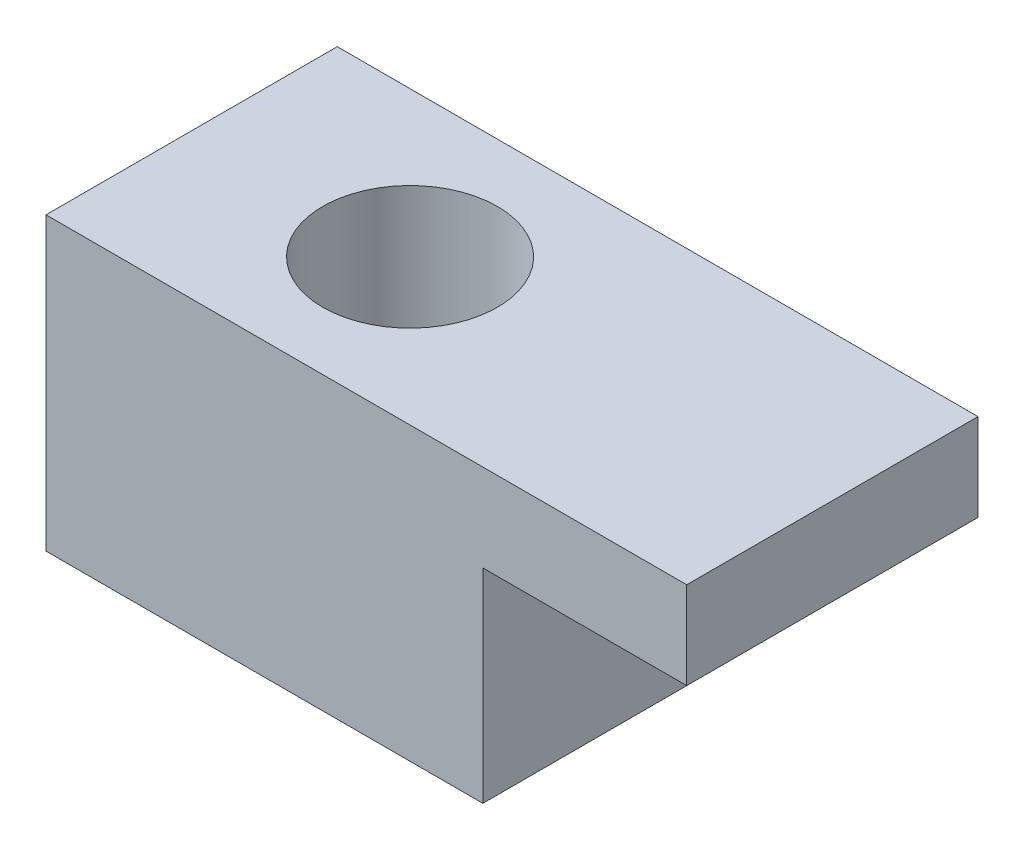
ISO-10303-21;
HEADER;
FILE_DESCRIPTION(('STEP AP214'),'2;1');
FILE_NAME('part.step','',(''),(''),'','','');
FILE_SCHEMA(('AUTOMOTIVE_DESIGN { 1 0 10303 214 1 1 1 1 }'));
ENDSEC;
DATA;
#1=APPLICATION_CONTEXT('core data for automotive mechanical design processes');
#2=APPLICATION_PROTOCOL_DEFINITION('international standard','automotive_design',2000,#1);
#3=PRODUCT_CONTEXT('',#1,'mechanical');
#4=PRODUCT('Part','Part','',(#3));
#5=PRODUCT_RELATED_PRODUCT_CATEGORY('part','',(#4));
#6=PRODUCT_DEFINITION_FORMATION('','',#4);
#7=PRODUCT_DEFINITION_CONTEXT('part definition',#1,'design');
#8=PRODUCT_DEFINITION('design','',#6,#7);
#9=PRODUCT_DEFINITION_SHAPE('','',#8);
#10=(LENGTH_UNIT() NAMED_UNIT(*) SI_UNIT(.MILLI.,.METRE.));
#11=(NAMED_UNIT(*) PLANE_ANGLE_UNIT() SI_UNIT($,.RADIAN.));
#12=(NAMED_UNIT(*) SI_UNIT($,.STERADIAN.) SOLID_ANGLE_UNIT());
#13=UNCERTAINTY_MEASURE_WITH_UNIT(LENGTH_MEASURE(1.E-05),#10,'distance_accuracy_value','');
#14=(GEOMETRIC_REPRESENTATION_CONTEXT(3) GLOBAL_UNCERTAINTY_ASSIGNED_CONTEXT((#13)) GLOBAL_UNIT_ASSIGNED_CONTEXT((#10,
#11,#12)) REPRESENTATION_CONTEXT('',''));
#15=CARTESIAN_POINT('',(0.,0.,0.));
#16=DIRECTION('',(0.,0.,1.));
#17=DIRECTION('',(1.,0.,0.));
#18=AXIS2_PLACEMENT_3D('',#15,#16,#17);
#19=CARTESIAN_POINT('',(0.,0.,10.));
#20=DIRECTION('',(1.,0.,0.));
#21=DIRECTION('',(0.,0.,-1.));
#22=AXIS2_PLACEMENT_3D('',#19,#20,#21);
#23=PLANE('',#22);
#24=DIRECTION('',(0.,-1.,0.));
#25=VECTOR('',#24,1.);
#26=CARTESIAN_POINT('',(0.,0.,0.));
#27=LINE('',#26,#25);
#28=CARTESIAN_POINT('',(0.,10.,0.));
#29=VERTEX_POINT('',#28);
#30=CARTESIAN_POINT('',(0.,0.,0.));
#31=VERTEX_POINT('',#30);
#32=EDGE_CURVE('E115',#29,#31,#27,.T.);
#33=ORIENTED_EDGE('',*,*,#32,.T.);
#34=DIRECTION('',(0.,0.,-1.));
#35=VECTOR('',#34,1.);
#36=CARTESIAN_POINT('',(0.,0.,10.));
#37=LINE('',#36,#35);
#38=CARTESIAN_POINT('',(0.,0.,10.));
#39=VERTEX_POINT('',#38);
#40=EDGE_CURVE('E11',#39,#31,#37,.T.);
#41=ORIENTED_EDGE('',*,*,#40,.F.);
#42=DIRECTION('',(0.,-1.,0.));
#43=VECTOR('',#42,1.);
#44=CARTESIAN_POINT('',(0.,0.,10.));
#45=LINE('',#44,#43);
#46=CARTESIAN_POINT('',(0.,10.,10.));
#47=VERTEX_POINT('',#46);
#48=EDGE_CURVE('E126',#47,#39,#45,.T.);
#49=ORIENTED_EDGE('',*,*,#48,.F.);
#50=DIRECTION('',(0.,0.,-1.));
#51=VECTOR('',#50,1.);
#52=CARTESIAN_POINT('',(0.,10.,10.));
#53=LINE('',#52,#51);
#54=EDGE_CURVE('E111',#47,#29,#53,.T.);
#55=ORIENTED_EDGE('',*,*,#54,.T.);
#56=EDGE_LOOP('',(#33,#41,#49,#55));
#57=FACE_BOUND('',#56,.T.);
#58=ADVANCED_FACE('F31',(#57),#23,.F.);
#59=CARTESIAN_POINT('',(0.,0.,10.));
#60=DIRECTION('',(0.,1.,0.));
#61=DIRECTION('',(0.,0.,1.));
#62=AXIS2_PLACEMENT_3D('',#59,#60,#61);
#63=PLANE('',#62);
#64=CARTESIAN_POINT('',(7.5,0.,5.));
#65=DIRECTION('',(0.,1.,0.));
#66=DIRECTION('',(0.,0.,1.));
#67=AXIS2_PLACEMENT_3D('',#64,#65,#66);
#68=CIRCLE('',#67,3.);
#69=CARTESIAN_POINT('',(7.5,0.,8.));
#70=VERTEX_POINT('',#69);
#71=EDGE_CURVE('E119',#70,#70,#68,.T.);
#72=ORIENTED_EDGE('',*,*,#71,.T.);
#73=EDGE_LOOP('',(#72));
#74=FACE_BOUND('',#73,.T.);
#75=DIRECTION('',(1.,0.,0.));
#76=VECTOR('',#75,1.);
#77=CARTESIAN_POINT('',(0.,0.,0.));
#78=LINE('',#77,#76);
#79=CARTESIAN_POINT('',(15.,0.,0.));
#80=VERTEX_POINT('',#79);
#81=EDGE_CURVE('E118',#31,#80,#78,.T.);
#82=ORIENTED_EDGE('',*,*,#81,.T.);
#83=DIRECTION('',(0.,0.,-1.));
#84=VECTOR('',#83,1.);
#85=CARTESIAN_POINT('',(15.,0.,10.));
#86=LINE('',#85,#84);
#87=CARTESIAN_POINT('',(15.,0.,10.));
#88=VERTEX_POINT('',#87);
#89=EDGE_CURVE('E39',#88,#80,#86,.T.);
#90=ORIENTED_EDGE('',*,*,#89,.F.);
#91=DIRECTION('',(1.,0.,0.));
#92=VECTOR('',#91,1.);
#93=CARTESIAN_POINT('',(0.,0.,10.));
#94=LINE('',#93,#92);
#95=EDGE_CURVE('E84',#39,#88,#94,.T.);
#96=ORIENTED_EDGE('',*,*,#95,.F.);
#97=ORIENTED_EDGE('',*,*,#40,.T.);
#98=EDGE_LOOP('',(#82,#90,#96,#97));
#99=FACE_BOUND('',#98,.T.);
#100=ADVANCED_FACE('F152',(#74,#99),#63,.F.);
#101=CARTESIAN_POINT('',(15.,0.,10.));
#102=DIRECTION('',(-1.,0.,0.));
#103=DIRECTION('',(0.,0.,1.));
#104=AXIS2_PLACEMENT_3D('',#101,#102,#103);
#105=PLANE('',#104);
#106=DIRECTION('',(0.,1.,0.));
#107=VECTOR('',#106,1.);
#108=CARTESIAN_POINT('',(15.,0.,0.));
#109=LINE('',#108,#107);
#110=CARTESIAN_POINT('',(15.,7.,0.));
#111=VERTEX_POINT('',#110);
#112=EDGE_CURVE('E121',#80,#111,#109,.T.);
#113=ORIENTED_EDGE('',*,*,#112,.T.);
#114=DIRECTION('',(0.,0.,-1.));
#115=VECTOR('',#114,1.);
#116=CARTESIAN_POINT('',(15.,7.,10.));
#117=LINE('',#116,#115);
#118=CARTESIAN_POINT('',(15.,7.,10.));
#119=VERTEX_POINT('',#118);
#120=EDGE_CURVE('E106',#119,#111,#117,.T.);
#121=ORIENTED_EDGE('',*,*,#120,.F.);
#122=DIRECTION('',(0.,1.,0.));
#123=VECTOR('',#122,1.);
#124=CARTESIAN_POINT('',(15.,0.,10.));
#125=LINE('',#124,#123);
#126=EDGE_CURVE('E97',#88,#119,#125,.T.);
#127=ORIENTED_EDGE('',*,*,#126,.F.);
#128=ORIENTED_EDGE('',*,*,#89,.T.);
#129=EDGE_LOOP('',(#113,#121,#127,#128));
#130=FACE_BOUND('',#129,.T.);
#131=ADVANCED_FACE('F132',(#130),#105,.F.);
#132=CARTESIAN_POINT('',(15.,7.,10.));
#133=DIRECTION('',(0.,1.,0.));
#134=DIRECTION('',(0.,0.,1.));
#135=AXIS2_PLACEMENT_3D('',#132,#133,#134);
#136=PLANE('',#135);
#137=DIRECTION('',(1.,0.,0.));
#138=VECTOR('',#137,1.);
#139=CARTESIAN_POINT('',(15.,7.,0.));
#140=LINE('',#139,#138);
#141=CARTESIAN_POINT('',(22.,7.,0.));
#142=VERTEX_POINT('',#141);
#143=EDGE_CURVE('E105',#111,#142,#140,.T.);
#144=ORIENTED_EDGE('',*,*,#143,.T.);
#145=DIRECTION('',(0.,0.,-1.));
#146=VECTOR('',#145,1.);
#147=CARTESIAN_POINT('',(22.,7.,10.));
#148=LINE('',#147,#146);
#149=CARTESIAN_POINT('',(22.,7.,10.));
#150=VERTEX_POINT('',#149);
#151=EDGE_CURVE('E102',#150,#142,#148,.T.);
#152=ORIENTED_EDGE('',*,*,#151,.F.);
#153=DIRECTION('',(1.,0.,0.));
#154=VECTOR('',#153,1.);
#155=CARTESIAN_POINT('',(15.,7.,10.));
#156=LINE('',#155,#154);
#157=EDGE_CURVE('E91',#119,#150,#156,.T.);
#158=ORIENTED_EDGE('',*,*,#157,.F.);
#159=ORIENTED_EDGE('',*,*,#120,.T.);
#160=EDGE_LOOP('',(#144,#152,#158,#159));
#161=FACE_BOUND('',#160,.T.);
#162=ADVANCED_FACE('F103',(#161),#136,.F.);
#163=CARTESIAN_POINT('',(22.,7.,10.));
#164=DIRECTION('',(-1.,0.,0.));
#165=DIRECTION('',(0.,0.,1.));
#166=AXIS2_PLACEMENT_3D('',#163,#164,#165);
#167=PLANE('',#166);
#168=DIRECTION('',(0.,1.,0.));
#169=VECTOR('',#168,1.);
#170=CARTESIAN_POINT('',(22.,7.,0.));
#171=LINE('',#170,#169);
#172=CARTESIAN_POINT('',(22.,10.,0.));
#173=VERTEX_POINT('',#172);
#174=EDGE_CURVE('E70',#142,#173,#171,.T.);
#175=ORIENTED_EDGE('',*,*,#174,.T.);
#176=DIRECTION('',(0.,0.,-1.));
#177=VECTOR('',#176,1.);
#178=CARTESIAN_POINT('',(22.,10.,10.));
#179=LINE('',#178,#177);
#180=CARTESIAN_POINT('',(22.,10.,10.));
#181=VERTEX_POINT('',#180);
#182=EDGE_CURVE('E107',#181,#173,#179,.T.);
#183=ORIENTED_EDGE('',*,*,#182,.F.);
#184=DIRECTION('',(0.,1.,0.));
#185=VECTOR('',#184,1.);
#186=CARTESIAN_POINT('',(22.,7.,10.));
#187=LINE('',#186,#185);
#188=EDGE_CURVE('E95',#150,#181,#187,.T.);
#189=ORIENTED_EDGE('',*,*,#188,.F.);
#190=ORIENTED_EDGE('',*,*,#151,.T.);
#191=EDGE_LOOP('',(#175,#183,#189,#190));
#192=FACE_BOUND('',#191,.T.);
#193=ADVANCED_FACE('F109',(#192),#167,.F.);
#194=CARTESIAN_POINT('',(0.,10.,10.));
#195=DIRECTION('',(0.,-1.,0.));
#196=DIRECTION('',(0.,0.,-1.));
#197=AXIS2_PLACEMENT_3D('',#194,#195,#196);
#198=PLANE('',#197);
#199=CARTESIAN_POINT('',(7.5,10.,5.));
#200=DIRECTION('',(0.,1.,0.));
#201=DIRECTION('',(0.,0.,1.));
#202=AXIS2_PLACEMENT_3D('',#199,#200,#201);
#203=CIRCLE('',#202,3.);
#204=CARTESIAN_POINT('',(7.5,10.,8.));
#205=VERTEX_POINT('',#204);
#206=EDGE_CURVE('E212',#205,#205,#203,.T.);
#207=ORIENTED_EDGE('',*,*,#206,.F.);
#208=EDGE_LOOP('',(#207));
#209=FACE_BOUND('',#208,.T.);
#210=DIRECTION('',(-1.,0.,0.));
#211=VECTOR('',#210,1.);
#212=CARTESIAN_POINT('',(0.,10.,0.));
#213=LINE('',#212,#211);
#214=EDGE_CURVE('E76',#173,#29,#213,.T.);
#215=ORIENTED_EDGE('',*,*,#214,.T.);
#216=ORIENTED_EDGE('',*,*,#54,.F.);
#217=DIRECTION('',(-1.,0.,0.));
#218=VECTOR('',#217,1.);
#219=CARTESIAN_POINT('',(0.,10.,10.));
#220=LINE('',#219,#218);
#221=EDGE_CURVE('E47',#181,#47,#220,.T.);
#222=ORIENTED_EDGE('',*,*,#221,.F.);
#223=ORIENTED_EDGE('',*,*,#182,.T.);
#224=EDGE_LOOP('',(#215,#216,#222,#223));
#225=FACE_BOUND('',#224,.T.);
#226=ADVANCED_FACE('F139',(#209,#225),#198,.F.);
#227=CARTESIAN_POINT('',(0.,10.,10.));
#228=DIRECTION('',(0.,0.,-1.));
#229=DIRECTION('',(-1.,0.,0.));
#230=AXIS2_PLACEMENT_3D('',#227,#228,#229);
#231=PLANE('',#230);
#232=ORIENTED_EDGE('',*,*,#48,.T.);
#233=ORIENTED_EDGE('',*,*,#95,.T.);
#234=ORIENTED_EDGE('',*,*,#126,.T.);
#235=ORIENTED_EDGE('',*,*,#157,.T.);
#236=ORIENTED_EDGE('',*,*,#188,.T.);
#237=ORIENTED_EDGE('',*,*,#221,.T.);
#238=EDGE_LOOP('',(#232,#233,#234,#235,#236,#237));
#239=FACE_BOUND('',#238,.T.);
#240=ADVANCED_FACE('F93',(#239),#231,.F.);
#241=CARTESIAN_POINT('',(0.,10.,0.));
#242=DIRECTION('',(0.,0.,-1.));
#243=DIRECTION('',(-1.,0.,0.));
#244=AXIS2_PLACEMENT_3D('',#241,#242,#243);
#245=PLANE('',#244);
#246=ORIENTED_EDGE('',*,*,#32,.F.);
#247=ORIENTED_EDGE('',*,*,#214,.F.);
#248=ORIENTED_EDGE('',*,*,#174,.F.);
#249=ORIENTED_EDGE('',*,*,#143,.F.);
#250=ORIENTED_EDGE('',*,*,#112,.F.);
#251=ORIENTED_EDGE('',*,*,#81,.F.);
#252=EDGE_LOOP('',(#246,#247,#248,#249,#250,#251));
#253=FACE_BOUND('',#252,.T.);
#254=ADVANCED_FACE('F135',(#253),#245,.T.);
#255=CARTESIAN_POINT('',(7.5,0.,5.));
#256=DIRECTION('',(0.,1.,0.));
#257=DIRECTION('',(0.,0.,1.));
#258=AXIS2_PLACEMENT_3D('',#255,#256,#257);
#259=CYLINDRICAL_SURFACE('',#258,3.);
#260=ORIENTED_EDGE('',*,*,#71,.F.);
#261=EDGE_LOOP('',(#260));
#262=FACE_BOUND('',#261,.T.);
#263=ORIENTED_EDGE('',*,*,#206,.T.);
#264=EDGE_LOOP('',(#263));
#265=FACE_BOUND('',#264,.T.);
#266=ADVANCED_FACE('F187',(#262,#265),#259,.F.);
#267=CLOSED_SHELL('',(#58,#100,#131,#162,#193,#226,#240,#254,#266));
#268=MANIFOLD_SOLID_BREP('B2',#267);
#269=ADVANCED_BREP_SHAPE_REPRESENTATION('',(#18,#268),#14);
#270=SHAPE_DEFINITION_REPRESENTATION(#9,#269);
ENDSEC;
END-ISO-10303-21;
